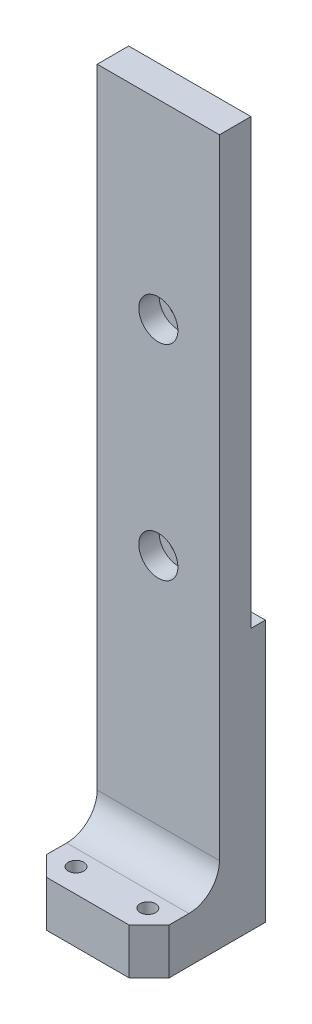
ISO-10303-21;
HEADER;
FILE_DESCRIPTION(('STEP AP214'),'2;1');
FILE_NAME('part.step','',(''),(''),'','','');
FILE_SCHEMA(('AUTOMOTIVE_DESIGN { 1 0 10303 214 1 1 1 1 }'));
ENDSEC;
DATA;
#1=APPLICATION_CONTEXT('core data for automotive mechanical design processes');
#2=APPLICATION_PROTOCOL_DEFINITION('international standard','automotive_design',2000,#1);
#3=PRODUCT_CONTEXT('',#1,'mechanical');
#4=PRODUCT('Part','Part','',(#3));
#5=PRODUCT_RELATED_PRODUCT_CATEGORY('part','',(#4));
#6=PRODUCT_DEFINITION_FORMATION('','',#4);
#7=PRODUCT_DEFINITION_CONTEXT('part definition',#1,'design');
#8=PRODUCT_DEFINITION('design','',#6,#7);
#9=PRODUCT_DEFINITION_SHAPE('','',#8);
#10=(LENGTH_UNIT() NAMED_UNIT(*) SI_UNIT(.MILLI.,.METRE.));
#11=(NAMED_UNIT(*) PLANE_ANGLE_UNIT() SI_UNIT($,.RADIAN.));
#12=(NAMED_UNIT(*) SI_UNIT($,.STERADIAN.) SOLID_ANGLE_UNIT());
#13=UNCERTAINTY_MEASURE_WITH_UNIT(LENGTH_MEASURE(1.E-05),#10,'distance_accuracy_value','');
#14=(GEOMETRIC_REPRESENTATION_CONTEXT(3) GLOBAL_UNCERTAINTY_ASSIGNED_CONTEXT((#13)) GLOBAL_UNIT_ASSIGNED_CONTEXT((#10,
#11,#12)) REPRESENTATION_CONTEXT('',''));
#15=CARTESIAN_POINT('',(0.,0.,0.));
#16=DIRECTION('',(0.,0.,1.));
#17=DIRECTION('',(1.,0.,0.));
#18=AXIS2_PLACEMENT_3D('',#15,#16,#17);
#19=CARTESIAN_POINT('',(-10.16,20.32,15.24));
#20=DIRECTION('',(0.,-1.,0.));
#21=DIRECTION('',(1.,0.,0.));
#22=AXIS2_PLACEMENT_3D('',#19,#20,#21);
#23=PLANE('',#22);
#24=DIRECTION('',(1.,0.,0.));
#25=VECTOR('',#24,1.);
#26=CARTESIAN_POINT('',(10.16,20.32,10.0076));
#27=LINE('',#26,#25);
#28=CARTESIAN_POINT('',(-10.16,20.32,10.0076));
#29=VERTEX_POINT('',#28);
#30=CARTESIAN_POINT('',(10.16,20.32,10.0076));
#31=VERTEX_POINT('',#30);
#32=EDGE_CURVE('E187',#29,#31,#27,.T.);
#33=ORIENTED_EDGE('',*,*,#32,.F.);
#34=DIRECTION('',(0.,0.,-1.));
#35=VECTOR('',#34,1.);
#36=CARTESIAN_POINT('',(-10.16,20.32,15.24));
#37=LINE('',#36,#35);
#38=CARTESIAN_POINT('',(-10.16,20.32,15.24));
#39=VERTEX_POINT('',#38);
#40=EDGE_CURVE('E275',#39,#29,#37,.T.);
#41=ORIENTED_EDGE('',*,*,#40,.F.);
#42=DIRECTION('',(-1.,0.,0.));
#43=VECTOR('',#42,1.);
#44=CARTESIAN_POINT('',(-10.16,20.32,15.24));
#45=LINE('',#44,#43);
#46=CARTESIAN_POINT('',(10.16,20.32,15.24));
#47=VERTEX_POINT('',#46);
#48=EDGE_CURVE('E277',#47,#39,#45,.T.);
#49=ORIENTED_EDGE('',*,*,#48,.F.);
#50=DIRECTION('',(0.,0.,-1.));
#51=VECTOR('',#50,1.);
#52=CARTESIAN_POINT('',(10.16,20.32,15.24));
#53=LINE('',#52,#51);
#54=EDGE_CURVE('E272',#47,#31,#53,.T.);
#55=ORIENTED_EDGE('',*,*,#54,.T.);
#56=EDGE_LOOP('',(#33,#41,#49,#55));
#57=FACE_BOUND('',#56,.T.);
#58=ADVANCED_FACE('F32',(#57),#23,.F.);
#59=CARTESIAN_POINT('',(-10.16,20.32,15.24));
#60=DIRECTION('',(1.,0.,0.));
#61=DIRECTION('',(0.,1.,0.));
#62=AXIS2_PLACEMENT_3D('',#59,#60,#61);
#63=PLANE('',#62);
#64=CARTESIAN_POINT('',(-10.1599999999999,-81.6102,11.43));
#65=DIRECTION('',(-1.,0.,0.));
#66=DIRECTION('',(0.,0.,1.));
#67=AXIS2_PLACEMENT_3D('',#64,#65,#66);
#68=CIRCLE('',#67,1.24999999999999);
#69=CARTESIAN_POINT('',(-10.1599999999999,-81.6102,12.68));
#70=VERTEX_POINT('',#69);
#71=EDGE_CURVE('E134',#70,#70,#68,.T.);
#72=ORIENTED_EDGE('',*,*,#71,.F.);
#73=EDGE_LOOP('',(#72));
#74=FACE_BOUND('',#73,.T.);
#75=DIRECTION('',(0.,0.,-1.));
#76=VECTOR('',#75,1.);
#77=CARTESIAN_POINT('',(-10.16,-96.8502,15.24));
#78=LINE('',#77,#76);
#79=CARTESIAN_POINT('',(-10.16,-96.8502,23.633303));
#80=VERTEX_POINT('',#79);
#81=CARTESIAN_POINT('',(-10.16,-96.8502,7.62));
#82=VERTEX_POINT('',#81);
#83=EDGE_CURVE('E202',#80,#82,#78,.T.);
#84=ORIENTED_EDGE('',*,*,#83,.F.);
#85=DIRECTION('',(0.,1.,0.));
#86=VECTOR('',#85,1.);
#87=CARTESIAN_POINT('',(-10.16,-89.2302,23.633303));
#88=LINE('',#87,#86);
#89=CARTESIAN_POINT('',(-10.16,-89.2302,23.633303));
#90=VERTEX_POINT('',#89);
#91=EDGE_CURVE('E11',#80,#90,#88,.T.);
#92=ORIENTED_EDGE('',*,*,#91,.T.);
#93=DIRECTION('',(0.,0.,-1.));
#94=VECTOR('',#93,1.);
#95=CARTESIAN_POINT('',(-10.16,-89.2302,26.935303));
#96=LINE('',#95,#94);
#97=CARTESIAN_POINT('',(-10.16,-89.2302,20.32));
#98=VERTEX_POINT('',#97);
#99=EDGE_CURVE('E201',#90,#98,#96,.T.);
#100=ORIENTED_EDGE('',*,*,#99,.T.);
#101=CARTESIAN_POINT('',(-10.16,-84.1502,20.32));
#102=DIRECTION('',(1.,0.,0.));
#103=DIRECTION('',(0.,1.,0.));
#104=AXIS2_PLACEMENT_3D('',#101,#102,#103);
#105=CIRCLE('',#104,5.08);
#106=CARTESIAN_POINT('',(-10.16,-84.1502,15.24));
#107=VERTEX_POINT('',#106);
#108=EDGE_CURVE('E286',#98,#107,#105,.T.);
#109=ORIENTED_EDGE('',*,*,#108,.T.);
#110=DIRECTION('',(0.,-1.,0.));
#111=VECTOR('',#110,1.);
#112=CARTESIAN_POINT('',(-10.16,20.32,15.24));
#113=LINE('',#112,#111);
#114=EDGE_CURVE('E215',#39,#107,#113,.T.);
#115=ORIENTED_EDGE('',*,*,#114,.F.);
#116=ORIENTED_EDGE('',*,*,#40,.T.);
#117=DIRECTION('',(0.,1.,0.));
#118=VECTOR('',#117,1.);
#119=CARTESIAN_POINT('',(-10.16,20.32,10.0076));
#120=LINE('',#119,#118);
#121=CARTESIAN_POINT('',(-10.16,-53.34,10.0076));
#122=VERTEX_POINT('',#121);
#123=EDGE_CURVE('E185',#122,#29,#120,.T.);
#124=ORIENTED_EDGE('',*,*,#123,.F.);
#125=DIRECTION('',(0.,0.,-1.));
#126=VECTOR('',#125,1.);
#127=CARTESIAN_POINT('',(-10.16,-53.34,10.0076));
#128=LINE('',#127,#126);
#129=CARTESIAN_POINT('',(-10.16,-53.34,7.62));
#130=VERTEX_POINT('',#129);
#131=EDGE_CURVE('E191',#122,#130,#128,.T.);
#132=ORIENTED_EDGE('',*,*,#131,.T.);
#133=DIRECTION('',(0.,1.,0.));
#134=VECTOR('',#133,1.);
#135=CARTESIAN_POINT('',(-10.16,-96.8502,7.62));
#136=LINE('',#135,#134);
#137=EDGE_CURVE('E220',#82,#130,#136,.T.);
#138=ORIENTED_EDGE('',*,*,#137,.F.);
#139=EDGE_LOOP('',(#84,#92,#100,#109,#115,#116,#124,#132,#138));
#140=FACE_BOUND('',#139,.T.);
#141=ADVANCED_FACE('F325',(#74,#140),#63,.F.);
#142=CARTESIAN_POINT('',(10.16,20.32,15.24));
#143=DIRECTION('',(-1.,0.,0.));
#144=DIRECTION('',(0.,-1.,0.));
#145=AXIS2_PLACEMENT_3D('',#142,#143,#144);
#146=PLANE('',#145);
#147=DIRECTION('',(0.,0.,-1.));
#148=VECTOR('',#147,1.);
#149=CARTESIAN_POINT('',(10.16,-89.2302,26.935303));
#150=LINE('',#149,#148);
#151=CARTESIAN_POINT('',(10.16,-89.2302,23.633303));
#152=VERTEX_POINT('',#151);
#153=CARTESIAN_POINT('',(10.16,-89.2302,20.32));
#154=VERTEX_POINT('',#153);
#155=EDGE_CURVE('E205',#152,#154,#150,.T.);
#156=ORIENTED_EDGE('',*,*,#155,.F.);
#157=DIRECTION('',(0.,-1.,0.));
#158=VECTOR('',#157,1.);
#159=CARTESIAN_POINT('',(10.16,-96.8502,23.633303));
#160=LINE('',#159,#158);
#161=CARTESIAN_POINT('',(10.16,-96.8502,23.633303));
#162=VERTEX_POINT('',#161);
#163=EDGE_CURVE('E57',#152,#162,#160,.T.);
#164=ORIENTED_EDGE('',*,*,#163,.T.);
#165=DIRECTION('',(0.,0.,1.));
#166=VECTOR('',#165,1.);
#167=CARTESIAN_POINT('',(10.16,-96.8502,15.24));
#168=LINE('',#167,#166);
#169=CARTESIAN_POINT('',(10.16,-96.8502,7.62));
#170=VERTEX_POINT('',#169);
#171=EDGE_CURVE('E207',#170,#162,#168,.T.);
#172=ORIENTED_EDGE('',*,*,#171,.F.);
#173=DIRECTION('',(0.,1.,0.));
#174=VECTOR('',#173,1.);
#175=CARTESIAN_POINT('',(10.16,-96.8502,7.62));
#176=LINE('',#175,#174);
#177=CARTESIAN_POINT('',(10.16,-53.34,7.62));
#178=VERTEX_POINT('',#177);
#179=EDGE_CURVE('E209',#170,#178,#176,.T.);
#180=ORIENTED_EDGE('',*,*,#179,.T.);
#181=DIRECTION('',(0.,0.,-1.));
#182=VECTOR('',#181,1.);
#183=CARTESIAN_POINT('',(10.16,-53.34,10.0076));
#184=LINE('',#183,#182);
#185=CARTESIAN_POINT('',(10.16,-53.34,10.0076));
#186=VERTEX_POINT('',#185);
#187=EDGE_CURVE('E189',#186,#178,#184,.T.);
#188=ORIENTED_EDGE('',*,*,#187,.F.);
#189=DIRECTION('',(0.,-1.,0.));
#190=VECTOR('',#189,1.);
#191=CARTESIAN_POINT('',(10.16,20.32,10.0076));
#192=LINE('',#191,#190);
#193=EDGE_CURVE('E178',#31,#186,#192,.T.);
#194=ORIENTED_EDGE('',*,*,#193,.F.);
#195=ORIENTED_EDGE('',*,*,#54,.F.);
#196=DIRECTION('',(0.,1.,0.));
#197=VECTOR('',#196,1.);
#198=CARTESIAN_POINT('',(10.16,20.32,15.24));
#199=LINE('',#198,#197);
#200=CARTESIAN_POINT('',(10.16,-84.1502,15.24));
#201=VERTEX_POINT('',#200);
#202=EDGE_CURVE('E219',#201,#47,#199,.T.);
#203=ORIENTED_EDGE('',*,*,#202,.F.);
#204=CARTESIAN_POINT('',(10.16,-84.1502,20.32));
#205=DIRECTION('',(-1.,0.,0.));
#206=DIRECTION('',(0.,-1.,0.));
#207=AXIS2_PLACEMENT_3D('',#204,#205,#206);
#208=CIRCLE('',#207,5.08);
#209=EDGE_CURVE('E288',#201,#154,#208,.T.);
#210=ORIENTED_EDGE('',*,*,#209,.T.);
#211=EDGE_LOOP('',(#156,#164,#172,#180,#188,#194,#195,#203,#210));
#212=FACE_BOUND('',#211,.T.);
#213=ADVANCED_FACE('F258',(#212),#146,.F.);
#214=CARTESIAN_POINT('',(-10.16,20.32,15.24));
#215=DIRECTION('',(0.,0.,1.));
#216=DIRECTION('',(1.,0.,0.));
#217=AXIS2_PLACEMENT_3D('',#214,#215,#216);
#218=PLANE('',#217);
#219=CARTESIAN_POINT('',(0.,-45.339,15.24));
#220=DIRECTION('',(0.,0.,1.));
#221=DIRECTION('',(1.,0.,0.));
#222=AXIS2_PLACEMENT_3D('',#219,#220,#221);
#223=CIRCLE('',#222,3.25);
#224=CARTESIAN_POINT('',(3.25,-45.339,15.24));
#225=VERTEX_POINT('',#224);
#226=EDGE_CURVE('E137',#225,#225,#223,.T.);
#227=ORIENTED_EDGE('',*,*,#226,.F.);
#228=EDGE_LOOP('',(#227));
#229=FACE_BOUND('',#228,.T.);
#230=CARTESIAN_POINT('',(0.,-11.3284,15.24));
#231=DIRECTION('',(0.,0.,1.));
#232=DIRECTION('',(1.,0.,0.));
#233=AXIS2_PLACEMENT_3D('',#230,#231,#232);
#234=CIRCLE('',#233,3.25);
#235=CARTESIAN_POINT('',(3.25,-11.3284,15.24));
#236=VERTEX_POINT('',#235);
#237=EDGE_CURVE('E148',#236,#236,#234,.T.);
#238=ORIENTED_EDGE('',*,*,#237,.F.);
#239=EDGE_LOOP('',(#238));
#240=FACE_BOUND('',#239,.T.);
#241=ORIENTED_EDGE('',*,*,#114,.T.);
#242=DIRECTION('',(-1.,0.,0.));
#243=VECTOR('',#242,1.);
#244=CARTESIAN_POINT('',(-10.16,-84.1502,15.24));
#245=LINE('',#244,#243);
#246=EDGE_CURVE('E284',#107,#201,#245,.F.);
#247=ORIENTED_EDGE('',*,*,#246,.T.);
#248=ORIENTED_EDGE('',*,*,#202,.T.);
#249=ORIENTED_EDGE('',*,*,#48,.T.);
#250=EDGE_LOOP('',(#241,#247,#248,#249));
#251=FACE_BOUND('',#250,.T.);
#252=ADVANCED_FACE('F335',(#229,#240,#251),#218,.T.);
#253=CARTESIAN_POINT('',(-10.16,-96.8502,7.62));
#254=DIRECTION('',(0.,0.,1.));
#255=DIRECTION('',(1.,0.,0.));
#256=AXIS2_PLACEMENT_3D('',#253,#254,#255);
#257=PLANE('',#256);
#258=ORIENTED_EDGE('',*,*,#137,.T.);
#259=DIRECTION('',(-1.,0.,0.));
#260=VECTOR('',#259,1.);
#261=CARTESIAN_POINT('',(10.16,-53.34,7.62));
#262=LINE('',#261,#260);
#263=EDGE_CURVE('E182',#178,#130,#262,.T.);
#264=ORIENTED_EDGE('',*,*,#263,.F.);
#265=ORIENTED_EDGE('',*,*,#179,.F.);
#266=DIRECTION('',(1.,0.,0.));
#267=VECTOR('',#266,1.);
#268=CARTESIAN_POINT('',(-10.16,-96.8502,7.62));
#269=LINE('',#268,#267);
#270=EDGE_CURVE('E204',#82,#170,#269,.T.);
#271=ORIENTED_EDGE('',*,*,#270,.F.);
#272=EDGE_LOOP('',(#258,#264,#265,#271));
#273=FACE_BOUND('',#272,.T.);
#274=ADVANCED_FACE('F264',(#273),#257,.F.);
#275=CARTESIAN_POINT('',(-10.16,-96.8502,7.62));
#276=DIRECTION('',(0.,-1.,0.));
#277=DIRECTION('',(0.,0.,-1.));
#278=AXIS2_PLACEMENT_3D('',#275,#276,#277);
#279=PLANE('',#278);
#280=CARTESIAN_POINT('',(5.96900000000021,-96.8502,11.6037812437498));
#281=DIRECTION('',(0.,-1.,0.));
#282=DIRECTION('',(0.,0.,-1.));
#283=AXIS2_PLACEMENT_3D('',#280,#281,#282);
#284=CIRCLE('',#283,1.28905);
#285=CARTESIAN_POINT('',(5.96900000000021,-96.8502,10.3147312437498));
#286=VERTEX_POINT('',#285);
#287=EDGE_CURVE('E161',#286,#286,#284,.T.);
#288=ORIENTED_EDGE('',*,*,#287,.F.);
#289=EDGE_LOOP('',(#288));
#290=FACE_BOUND('',#289,.T.);
#291=CARTESIAN_POINT('',(-5.96900000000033,-96.8502,11.6037812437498));
#292=DIRECTION('',(0.,-1.,0.));
#293=DIRECTION('',(0.,0.,-1.));
#294=AXIS2_PLACEMENT_3D('',#291,#292,#293);
#295=CIRCLE('',#294,1.28905);
#296=CARTESIAN_POINT('',(-5.96900000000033,-96.8502,10.3147312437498));
#297=VERTEX_POINT('',#296);
#298=EDGE_CURVE('E167',#297,#297,#295,.T.);
#299=ORIENTED_EDGE('',*,*,#298,.F.);
#300=EDGE_LOOP('',(#299));
#301=FACE_BOUND('',#300,.T.);
#302=CARTESIAN_POINT('',(-5.96900000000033,-96.8502,22.9515217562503));
#303=DIRECTION('',(0.,-1.,0.));
#304=DIRECTION('',(0.,0.,-1.));
#305=AXIS2_PLACEMENT_3D('',#302,#303,#304);
#306=CIRCLE('',#305,1.28905);
#307=CARTESIAN_POINT('',(-5.96900000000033,-96.8502,21.6624717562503));
#308=VERTEX_POINT('',#307);
#309=EDGE_CURVE('E170',#308,#308,#306,.T.);
#310=ORIENTED_EDGE('',*,*,#309,.F.);
#311=EDGE_LOOP('',(#310));
#312=FACE_BOUND('',#311,.T.);
#313=CARTESIAN_POINT('',(5.96900000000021,-96.8502,22.9515217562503));
#314=DIRECTION('',(0.,-1.,0.));
#315=DIRECTION('',(0.,0.,-1.));
#316=AXIS2_PLACEMENT_3D('',#313,#314,#315);
#317=CIRCLE('',#316,1.28905);
#318=CARTESIAN_POINT('',(5.96900000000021,-96.8502,21.6624717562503));
#319=VERTEX_POINT('',#318);
#320=EDGE_CURVE('E174',#319,#319,#317,.T.);
#321=ORIENTED_EDGE('',*,*,#320,.F.);
#322=EDGE_LOOP('',(#321));
#323=FACE_BOUND('',#322,.T.);
#324=ORIENTED_EDGE('',*,*,#171,.T.);
#325=DIRECTION('',(-0.707106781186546,0.,0.707106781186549));
#326=VECTOR('',#325,1.);
#327=CARTESIAN_POINT('',(8.00665150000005,-96.8502,25.7866515));
#328=LINE('',#327,#326);
#329=CARTESIAN_POINT('',(6.85800000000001,-96.8502,26.935303));
#330=VERTEX_POINT('',#329);
#331=EDGE_CURVE('E41',#162,#330,#328,.T.);
#332=ORIENTED_EDGE('',*,*,#331,.T.);
#333=DIRECTION('',(1.,0.,0.));
#334=VECTOR('',#333,1.);
#335=CARTESIAN_POINT('',(10.16,-96.8502,26.935303));
#336=LINE('',#335,#334);
#337=CARTESIAN_POINT('',(-6.858,-96.8502,26.935303));
#338=VERTEX_POINT('',#337);
#339=EDGE_CURVE('E198',#338,#330,#336,.T.);
#340=ORIENTED_EDGE('',*,*,#339,.F.);
#341=DIRECTION('',(-0.707106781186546,0.,-0.707106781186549));
#342=VECTOR('',#341,1.);
#343=CARTESIAN_POINT('',(-18.1666515,-96.8502,15.6266515));
#344=LINE('',#343,#342);
#345=EDGE_CURVE('E49',#338,#80,#344,.T.);
#346=ORIENTED_EDGE('',*,*,#345,.T.);
#347=ORIENTED_EDGE('',*,*,#83,.T.);
#348=ORIENTED_EDGE('',*,*,#270,.T.);
#349=EDGE_LOOP('',(#324,#332,#340,#346,#347,#348));
#350=FACE_BOUND('',#349,.T.);
#351=ADVANCED_FACE('F312',(#290,#301,#312,#323,#350),#279,.T.);
#352=CARTESIAN_POINT('',(10.16,-89.2302,26.935303));
#353=DIRECTION('',(0.,-1.,0.));
#354=DIRECTION('',(0.,0.,-1.));
#355=AXIS2_PLACEMENT_3D('',#352,#353,#354);
#356=PLANE('',#355);
#357=CARTESIAN_POINT('',(-5.96900000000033,-89.2302,22.9515217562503));
#358=DIRECTION('',(0.,-1.,0.));
#359=DIRECTION('',(0.,0.,-1.));
#360=AXIS2_PLACEMENT_3D('',#357,#358,#359);
#361=CIRCLE('',#360,1.28905);
#362=CARTESIAN_POINT('',(-5.96900000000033,-89.2302,21.6624717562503));
#363=VERTEX_POINT('',#362);
#364=EDGE_CURVE('E173',#363,#363,#361,.T.);
#365=ORIENTED_EDGE('',*,*,#364,.T.);
#366=EDGE_LOOP('',(#365));
#367=FACE_BOUND('',#366,.T.);
#368=CARTESIAN_POINT('',(5.96900000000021,-89.2302,22.9515217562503));
#369=DIRECTION('',(0.,-1.,0.));
#370=DIRECTION('',(0.,0.,-1.));
#371=AXIS2_PLACEMENT_3D('',#368,#369,#370);
#372=CIRCLE('',#371,1.28905);
#373=CARTESIAN_POINT('',(5.96900000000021,-89.2302,21.6624717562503));
#374=VERTEX_POINT('',#373);
#375=EDGE_CURVE('E177',#374,#374,#372,.T.);
#376=ORIENTED_EDGE('',*,*,#375,.T.);
#377=EDGE_LOOP('',(#376));
#378=FACE_BOUND('',#377,.T.);
#379=DIRECTION('',(-1.,0.,0.));
#380=VECTOR('',#379,1.);
#381=CARTESIAN_POINT('',(10.16,-89.2302,26.935303));
#382=LINE('',#381,#380);
#383=CARTESIAN_POINT('',(6.85800000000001,-89.2302,26.935303));
#384=VERTEX_POINT('',#383);
#385=CARTESIAN_POINT('',(-6.858,-89.2302,26.935303));
#386=VERTEX_POINT('',#385);
#387=EDGE_CURVE('E194',#384,#386,#382,.T.);
#388=ORIENTED_EDGE('',*,*,#387,.F.);
#389=DIRECTION('',(0.707106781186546,0.,-0.707106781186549));
#390=VECTOR('',#389,1.);
#391=CARTESIAN_POINT('',(6.85800000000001,-89.2302,26.935303));
#392=LINE('',#391,#390);
#393=EDGE_CURVE('E233',#384,#152,#392,.T.);
#394=ORIENTED_EDGE('',*,*,#393,.T.);
#395=ORIENTED_EDGE('',*,*,#155,.T.);
#396=DIRECTION('',(-1.,0.,0.));
#397=VECTOR('',#396,1.);
#398=CARTESIAN_POINT('',(10.16,-89.2302,20.32));
#399=LINE('',#398,#397);
#400=EDGE_CURVE('E274',#154,#98,#399,.T.);
#401=ORIENTED_EDGE('',*,*,#400,.T.);
#402=ORIENTED_EDGE('',*,*,#99,.F.);
#403=DIRECTION('',(0.707106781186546,0.,0.707106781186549));
#404=VECTOR('',#403,1.);
#405=CARTESIAN_POINT('',(-6.85800000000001,-89.2302,26.935303));
#406=LINE('',#405,#404);
#407=EDGE_CURVE('E231',#90,#386,#406,.T.);
#408=ORIENTED_EDGE('',*,*,#407,.T.);
#409=EDGE_LOOP('',(#388,#394,#395,#401,#402,#408));
#410=FACE_BOUND('',#409,.T.);
#411=ADVANCED_FACE('F306',(#367,#378,#410),#356,.F.);
#412=CARTESIAN_POINT('',(10.16,-89.2302,26.935303));
#413=DIRECTION('',(0.,0.,1.));
#414=DIRECTION('',(1.,0.,0.));
#415=AXIS2_PLACEMENT_3D('',#412,#413,#414);
#416=PLANE('',#415);
#417=ORIENTED_EDGE('',*,*,#339,.T.);
#418=DIRECTION('',(0.,1.,0.));
#419=VECTOR('',#418,1.);
#420=CARTESIAN_POINT('',(6.85800000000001,-89.2302,26.935303));
#421=LINE('',#420,#419);
#422=EDGE_CURVE('E234',#330,#384,#421,.T.);
#423=ORIENTED_EDGE('',*,*,#422,.T.);
#424=ORIENTED_EDGE('',*,*,#387,.T.);
#425=DIRECTION('',(0.,-1.,0.));
#426=VECTOR('',#425,1.);
#427=CARTESIAN_POINT('',(-6.85800000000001,-96.8502,26.935303));
#428=LINE('',#427,#426);
#429=EDGE_CURVE('E291',#386,#338,#428,.T.);
#430=ORIENTED_EDGE('',*,*,#429,.T.);
#431=EDGE_LOOP('',(#417,#423,#424,#430));
#432=FACE_BOUND('',#431,.T.);
#433=ADVANCED_FACE('F301',(#432),#416,.T.);
#434=CARTESIAN_POINT('',(10.16,-53.34,10.0076));
#435=DIRECTION('',(0.,-1.,0.));
#436=DIRECTION('',(0.,0.,-1.));
#437=AXIS2_PLACEMENT_3D('',#434,#435,#436);
#438=PLANE('',#437);
#439=ORIENTED_EDGE('',*,*,#263,.T.);
#440=ORIENTED_EDGE('',*,*,#131,.F.);
#441=DIRECTION('',(-1.,0.,0.));
#442=VECTOR('',#441,1.);
#443=CARTESIAN_POINT('',(10.16,-53.34,10.0076));
#444=LINE('',#443,#442);
#445=EDGE_CURVE('E181',#186,#122,#444,.T.);
#446=ORIENTED_EDGE('',*,*,#445,.F.);
#447=ORIENTED_EDGE('',*,*,#187,.T.);
#448=EDGE_LOOP('',(#439,#440,#446,#447));
#449=FACE_BOUND('',#448,.T.);
#450=ADVANCED_FACE('F248',(#449),#438,.F.);
#451=CARTESIAN_POINT('',(10.16,-53.34,10.0076));
#452=DIRECTION('',(0.,0.,-1.));
#453=DIRECTION('',(-1.,0.,0.));
#454=AXIS2_PLACEMENT_3D('',#451,#452,#453);
#455=PLANE('',#454);
#456=CARTESIAN_POINT('',(0.,-45.339,10.0076));
#457=DIRECTION('',(0.,0.,-1.));
#458=DIRECTION('',(-1.,0.,0.));
#459=AXIS2_PLACEMENT_3D('',#456,#457,#458);
#460=CIRCLE('',#459,1.6);
#461=CARTESIAN_POINT('',(-1.6,-45.339,10.0076));
#462=VERTEX_POINT('',#461);
#463=EDGE_CURVE('E36',#462,#462,#460,.T.);
#464=ORIENTED_EDGE('',*,*,#463,.F.);
#465=EDGE_LOOP('',(#464));
#466=FACE_BOUND('',#465,.T.);
#467=CARTESIAN_POINT('',(0.,-11.3284,10.0076));
#468=DIRECTION('',(0.,0.,-1.));
#469=DIRECTION('',(-1.,0.,0.));
#470=AXIS2_PLACEMENT_3D('',#467,#468,#469);
#471=CIRCLE('',#470,1.6);
#472=CARTESIAN_POINT('',(-1.6,-11.3284,10.0076));
#473=VERTEX_POINT('',#472);
#474=EDGE_CURVE('E157',#473,#473,#471,.T.);
#475=ORIENTED_EDGE('',*,*,#474,.F.);
#476=EDGE_LOOP('',(#475));
#477=FACE_BOUND('',#476,.T.);
#478=ORIENTED_EDGE('',*,*,#193,.T.);
#479=ORIENTED_EDGE('',*,*,#445,.T.);
#480=ORIENTED_EDGE('',*,*,#123,.T.);
#481=ORIENTED_EDGE('',*,*,#32,.T.);
#482=EDGE_LOOP('',(#478,#479,#480,#481));
#483=FACE_BOUND('',#482,.T.);
#484=ADVANCED_FACE('F244',(#466,#477,#483),#455,.T.);
#485=CARTESIAN_POINT('',(10.16,-84.1502,20.32));
#486=DIRECTION('',(-1.,0.,0.));
#487=DIRECTION('',(0.,0.,1.));
#488=AXIS2_PLACEMENT_3D('',#485,#486,#487);
#489=CYLINDRICAL_SURFACE('',#488,5.08);
#490=ORIENTED_EDGE('',*,*,#209,.F.);
#491=ORIENTED_EDGE('',*,*,#246,.F.);
#492=ORIENTED_EDGE('',*,*,#108,.F.);
#493=ORIENTED_EDGE('',*,*,#400,.F.);
#494=EDGE_LOOP('',(#490,#491,#492,#493));
#495=FACE_BOUND('',#494,.T.);
#496=ADVANCED_FACE('F247',(#495),#489,.F.);
#497=CARTESIAN_POINT('',(5.96900000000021,-96.8502,22.9515217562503));
#498=DIRECTION('',(0.,-1.,0.));
#499=DIRECTION('',(0.,0.,-1.));
#500=AXIS2_PLACEMENT_3D('',#497,#498,#499);
#501=CYLINDRICAL_SURFACE('',#500,1.28905);
#502=ORIENTED_EDGE('',*,*,#320,.T.);
#503=EDGE_LOOP('',(#502));
#504=FACE_BOUND('',#503,.T.);
#505=ORIENTED_EDGE('',*,*,#375,.F.);
#506=EDGE_LOOP('',(#505));
#507=FACE_BOUND('',#506,.T.);
#508=ADVANCED_FACE('F339',(#504,#507),#501,.F.);
#509=CARTESIAN_POINT('',(-5.96900000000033,-96.8502,22.9515217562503));
#510=DIRECTION('',(0.,-1.,0.));
#511=DIRECTION('',(0.,0.,-1.));
#512=AXIS2_PLACEMENT_3D('',#509,#510,#511);
#513=CYLINDRICAL_SURFACE('',#512,1.28905);
#514=ORIENTED_EDGE('',*,*,#309,.T.);
#515=EDGE_LOOP('',(#514));
#516=FACE_BOUND('',#515,.T.);
#517=ORIENTED_EDGE('',*,*,#364,.F.);
#518=EDGE_LOOP('',(#517));
#519=FACE_BOUND('',#518,.T.);
#520=ADVANCED_FACE('F344',(#516,#519),#513,.F.);
#521=CARTESIAN_POINT('',(-5.96900000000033,-96.8502,11.6037812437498));
#522=DIRECTION('',(0.,-1.,0.));
#523=DIRECTION('',(0.,0.,-1.));
#524=AXIS2_PLACEMENT_3D('',#521,#522,#523);
#525=CYLINDRICAL_SURFACE('',#524,1.28905);
#526=CARTESIAN_POINT('',(-5.96900000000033,-88.5952,11.6037812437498));
#527=DIRECTION('',(0.,-1.,0.));
#528=DIRECTION('',(0.,0.,-1.));
#529=AXIS2_PLACEMENT_3D('',#526,#527,#528);
#530=CIRCLE('',#529,1.28905);
#531=CARTESIAN_POINT('',(-5.96900000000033,-88.5952,10.3147312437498));
#532=VERTEX_POINT('',#531);
#533=EDGE_CURVE('E164',#532,#532,#530,.T.);
#534=ORIENTED_EDGE('',*,*,#533,.F.);
#535=EDGE_LOOP('',(#534));
#536=FACE_BOUND('',#535,.T.);
#537=ORIENTED_EDGE('',*,*,#298,.T.);
#538=EDGE_LOOP('',(#537));
#539=FACE_BOUND('',#538,.T.);
#540=ADVANCED_FACE('F387',(#536,#539),#525,.F.);
#541=CARTESIAN_POINT('',(-5.96900000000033,-88.5952,11.6037812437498));
#542=DIRECTION('',(0.,-1.,0.));
#543=DIRECTION('',(0.,0.,-1.));
#544=AXIS2_PLACEMENT_3D('',#541,#542,#543);
#545=CONICAL_SURFACE('',#544,1.28905,1.02974425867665);
#546=CARTESIAN_POINT('',(-5.96900000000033,-87.8206606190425,11.6037812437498));
#547=VERTEX_POINT('',#546);
#548=VERTEX_LOOP('',#547);
#549=FACE_BOUND('',#548,.T.);
#550=ORIENTED_EDGE('',*,*,#533,.T.);
#551=EDGE_LOOP('',(#550));
#552=FACE_BOUND('',#551,.T.);
#553=ADVANCED_FACE('F383',(#549,#552),#545,.F.);
#554=CARTESIAN_POINT('',(5.96900000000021,-96.8502,11.6037812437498));
#555=DIRECTION('',(0.,-1.,0.));
#556=DIRECTION('',(0.,0.,-1.));
#557=AXIS2_PLACEMENT_3D('',#554,#555,#556);
#558=CYLINDRICAL_SURFACE('',#557,1.28905);
#559=CARTESIAN_POINT('',(5.96900000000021,-88.5952,11.6037812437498));
#560=DIRECTION('',(0.,-1.,0.));
#561=DIRECTION('',(0.,0.,-1.));
#562=AXIS2_PLACEMENT_3D('',#559,#560,#561);
#563=CIRCLE('',#562,1.28905);
#564=CARTESIAN_POINT('',(5.96900000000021,-88.5952,10.3147312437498));
#565=VERTEX_POINT('',#564);
#566=EDGE_CURVE('E158',#565,#565,#563,.T.);
#567=ORIENTED_EDGE('',*,*,#566,.F.);
#568=EDGE_LOOP('',(#567));
#569=FACE_BOUND('',#568,.T.);
#570=ORIENTED_EDGE('',*,*,#287,.T.);
#571=EDGE_LOOP('',(#570));
#572=FACE_BOUND('',#571,.T.);
#573=ADVANCED_FACE('F320',(#569,#572),#558,.F.);
#574=CARTESIAN_POINT('',(5.96900000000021,-88.5952,11.6037812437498));
#575=DIRECTION('',(0.,-1.,0.));
#576=DIRECTION('',(0.,0.,-1.));
#577=AXIS2_PLACEMENT_3D('',#574,#575,#576);
#578=CONICAL_SURFACE('',#577,1.28905,1.02974425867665);
#579=CARTESIAN_POINT('',(5.96900000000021,-87.8206606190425,11.6037812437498));
#580=VERTEX_POINT('',#579);
#581=VERTEX_LOOP('',#580);
#582=FACE_BOUND('',#581,.T.);
#583=ORIENTED_EDGE('',*,*,#566,.T.);
#584=EDGE_LOOP('',(#583));
#585=FACE_BOUND('',#584,.T.);
#586=ADVANCED_FACE('F315',(#582,#585),#578,.F.);
#587=CARTESIAN_POINT('',(6.85800000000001,-89.2302,26.935303));
#588=DIRECTION('',(0.707106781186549,0.,0.707106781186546));
#589=DIRECTION('',(0.707106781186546,0.,-0.707106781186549));
#590=AXIS2_PLACEMENT_3D('',#587,#588,#589);
#591=PLANE('',#590);
#592=ORIENTED_EDGE('',*,*,#331,.F.);
#593=ORIENTED_EDGE('',*,*,#163,.F.);
#594=ORIENTED_EDGE('',*,*,#393,.F.);
#595=ORIENTED_EDGE('',*,*,#422,.F.);
#596=EDGE_LOOP('',(#592,#593,#594,#595));
#597=FACE_BOUND('',#596,.T.);
#598=ADVANCED_FACE('F313',(#597),#591,.T.);
#599=CARTESIAN_POINT('',(-6.85800000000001,-89.2302,26.935303));
#600=DIRECTION('',(-0.707106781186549,0.,0.707106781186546));
#601=DIRECTION('',(0.707106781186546,0.,0.707106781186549));
#602=AXIS2_PLACEMENT_3D('',#599,#600,#601);
#603=PLANE('',#602);
#604=ORIENTED_EDGE('',*,*,#407,.F.);
#605=ORIENTED_EDGE('',*,*,#91,.F.);
#606=ORIENTED_EDGE('',*,*,#345,.F.);
#607=ORIENTED_EDGE('',*,*,#429,.F.);
#608=EDGE_LOOP('',(#604,#605,#606,#607));
#609=FACE_BOUND('',#608,.T.);
#610=ADVANCED_FACE('F34',(#609),#603,.T.);
#611=CARTESIAN_POINT('',(0.,-11.3284,15.24));
#612=DIRECTION('',(0.,0.,1.));
#613=DIRECTION('',(1.,0.,0.));
#614=AXIS2_PLACEMENT_3D('',#611,#612,#613);
#615=CYLINDRICAL_SURFACE('',#614,1.6);
#616=ORIENTED_EDGE('',*,*,#474,.T.);
#617=EDGE_LOOP('',(#616));
#618=FACE_BOUND('',#617,.T.);
#619=CARTESIAN_POINT('',(0.,-11.3284,11.859));
#620=DIRECTION('',(0.,0.,1.));
#621=DIRECTION('',(1.,0.,0.));
#622=AXIS2_PLACEMENT_3D('',#619,#620,#621);
#623=CIRCLE('',#622,1.6);
#624=CARTESIAN_POINT('',(1.6,-11.3284,11.859));
#625=VERTEX_POINT('',#624);
#626=EDGE_CURVE('E154',#625,#625,#623,.T.);
#627=ORIENTED_EDGE('',*,*,#626,.T.);
#628=EDGE_LOOP('',(#627));
#629=FACE_BOUND('',#628,.T.);
#630=ADVANCED_FACE('F241',(#618,#629),#615,.F.);
#631=CARTESIAN_POINT('',(1.6,-11.3284,11.859));
#632=DIRECTION('',(0.,0.,-1.));
#633=DIRECTION('',(-1.,0.,0.));
#634=AXIS2_PLACEMENT_3D('',#631,#632,#633);
#635=PLANE('',#634);
#636=ORIENTED_EDGE('',*,*,#626,.F.);
#637=EDGE_LOOP('',(#636));
#638=FACE_BOUND('',#637,.T.);
#639=CARTESIAN_POINT('',(0.,-11.3284,11.859));
#640=DIRECTION('',(0.,0.,1.));
#641=DIRECTION('',(1.,0.,0.));
#642=AXIS2_PLACEMENT_3D('',#639,#640,#641);
#643=CIRCLE('',#642,3.25);
#644=CARTESIAN_POINT('',(3.25,-11.3284,11.859));
#645=VERTEX_POINT('',#644);
#646=EDGE_CURVE('E151',#645,#645,#643,.T.);
#647=ORIENTED_EDGE('',*,*,#646,.T.);
#648=EDGE_LOOP('',(#647));
#649=FACE_BOUND('',#648,.T.);
#650=ADVANCED_FACE('F364',(#638,#649),#635,.F.);
#651=CARTESIAN_POINT('',(0.,-11.3284,15.24));
#652=DIRECTION('',(0.,0.,1.));
#653=DIRECTION('',(1.,0.,0.));
#654=AXIS2_PLACEMENT_3D('',#651,#652,#653);
#655=CYLINDRICAL_SURFACE('',#654,3.25);
#656=ORIENTED_EDGE('',*,*,#646,.F.);
#657=EDGE_LOOP('',(#656));
#658=FACE_BOUND('',#657,.T.);
#659=ORIENTED_EDGE('',*,*,#237,.T.);
#660=EDGE_LOOP('',(#659));
#661=FACE_BOUND('',#660,.T.);
#662=ADVANCED_FACE('F361',(#658,#661),#655,.F.);
#663=CARTESIAN_POINT('',(0.,-45.339,15.24));
#664=DIRECTION('',(0.,0.,1.));
#665=DIRECTION('',(1.,0.,0.));
#666=AXIS2_PLACEMENT_3D('',#663,#664,#665);
#667=CYLINDRICAL_SURFACE('',#666,1.6);
#668=ORIENTED_EDGE('',*,*,#463,.T.);
#669=EDGE_LOOP('',(#668));
#670=FACE_BOUND('',#669,.T.);
#671=CARTESIAN_POINT('',(0.,-45.339,11.859));
#672=DIRECTION('',(0.,0.,1.));
#673=DIRECTION('',(1.,0.,0.));
#674=AXIS2_PLACEMENT_3D('',#671,#672,#673);
#675=CIRCLE('',#674,1.6);
#676=CARTESIAN_POINT('',(1.6,-45.339,11.859));
#677=VERTEX_POINT('',#676);
#678=EDGE_CURVE('E145',#677,#677,#675,.T.);
#679=ORIENTED_EDGE('',*,*,#678,.T.);
#680=EDGE_LOOP('',(#679));
#681=FACE_BOUND('',#680,.T.);
#682=ADVANCED_FACE('F363',(#670,#681),#667,.F.);
#683=CARTESIAN_POINT('',(1.6,-45.339,11.859));
#684=DIRECTION('',(0.,0.,-1.));
#685=DIRECTION('',(-1.,0.,0.));
#686=AXIS2_PLACEMENT_3D('',#683,#684,#685);
#687=PLANE('',#686);
#688=ORIENTED_EDGE('',*,*,#678,.F.);
#689=EDGE_LOOP('',(#688));
#690=FACE_BOUND('',#689,.T.);
#691=CARTESIAN_POINT('',(0.,-45.339,11.859));
#692=DIRECTION('',(0.,0.,1.));
#693=DIRECTION('',(1.,0.,0.));
#694=AXIS2_PLACEMENT_3D('',#691,#692,#693);
#695=CIRCLE('',#694,3.25);
#696=CARTESIAN_POINT('',(3.25,-45.339,11.859));
#697=VERTEX_POINT('',#696);
#698=EDGE_CURVE('E142',#697,#697,#695,.T.);
#699=ORIENTED_EDGE('',*,*,#698,.T.);
#700=EDGE_LOOP('',(#699));
#701=FACE_BOUND('',#700,.T.);
#702=ADVANCED_FACE('F371',(#690,#701),#687,.F.);
#703=CARTESIAN_POINT('',(0.,-45.339,15.24));
#704=DIRECTION('',(0.,0.,1.));
#705=DIRECTION('',(1.,0.,0.));
#706=AXIS2_PLACEMENT_3D('',#703,#704,#705);
#707=CYLINDRICAL_SURFACE('',#706,3.25);
#708=ORIENTED_EDGE('',*,*,#698,.F.);
#709=EDGE_LOOP('',(#708));
#710=FACE_BOUND('',#709,.T.);
#711=ORIENTED_EDGE('',*,*,#226,.T.);
#712=EDGE_LOOP('',(#711));
#713=FACE_BOUND('',#712,.T.);
#714=ADVANCED_FACE('F475',(#710,#713),#707,.F.);
#715=CARTESIAN_POINT('',(-10.1599999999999,-81.6102,11.43));
#716=DIRECTION('',(-1.,0.,0.));
#717=DIRECTION('',(0.,0.,1.));
#718=AXIS2_PLACEMENT_3D('',#715,#716,#717);
#719=CYLINDRICAL_SURFACE('',#718,1.24999999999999);
#720=CARTESIAN_POINT('',(-2.53999999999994,-81.6102,11.43));
#721=DIRECTION('',(-1.,0.,0.));
#722=DIRECTION('',(0.,0.,1.));
#723=AXIS2_PLACEMENT_3D('',#720,#721,#722);
#724=CIRCLE('',#723,1.24999999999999);
#725=CARTESIAN_POINT('',(-2.53999999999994,-81.6102,12.68));
#726=VERTEX_POINT('',#725);
#727=EDGE_CURVE('E132',#726,#726,#724,.T.);
#728=ORIENTED_EDGE('',*,*,#727,.F.);
#729=EDGE_LOOP('',(#728));
#730=FACE_BOUND('',#729,.T.);
#731=ORIENTED_EDGE('',*,*,#71,.T.);
#732=EDGE_LOOP('',(#731));
#733=FACE_BOUND('',#732,.T.);
#734=ADVANCED_FACE('F128',(#730,#733),#719,.F.);
#735=CARTESIAN_POINT('',(-2.53999999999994,-81.6102,11.43));
#736=DIRECTION('',(-1.,0.,0.));
#737=DIRECTION('',(0.,0.,1.));
#738=AXIS2_PLACEMENT_3D('',#735,#736,#737);
#739=CONICAL_SURFACE('',#738,1.24999999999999,1.02974425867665);
#740=CARTESIAN_POINT('',(-1.78892422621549,-81.6102,11.43));
#741=VERTEX_POINT('',#740);
#742=VERTEX_LOOP('',#741);
#743=FACE_BOUND('',#742,.T.);
#744=ORIENTED_EDGE('',*,*,#727,.T.);
#745=EDGE_LOOP('',(#744));
#746=FACE_BOUND('',#745,.T.);
#747=ADVANCED_FACE('F125',(#743,#746),#739,.F.);
#748=CLOSED_SHELL('',(#58,#141,#213,#252,#274,#351,#411,#433,#450,#484,#496,#508,#520,#540,#553,
#573,#586,#598,#610,#630,#650,#662,#682,#702,#714,#734,#747));
#749=MANIFOLD_SOLID_BREP('B2',#748);
#750=ADVANCED_BREP_SHAPE_REPRESENTATION('',(#18,#749),#14);
#751=SHAPE_DEFINITION_REPRESENTATION(#9,#750);
ENDSEC;
END-ISO-10303-21;
